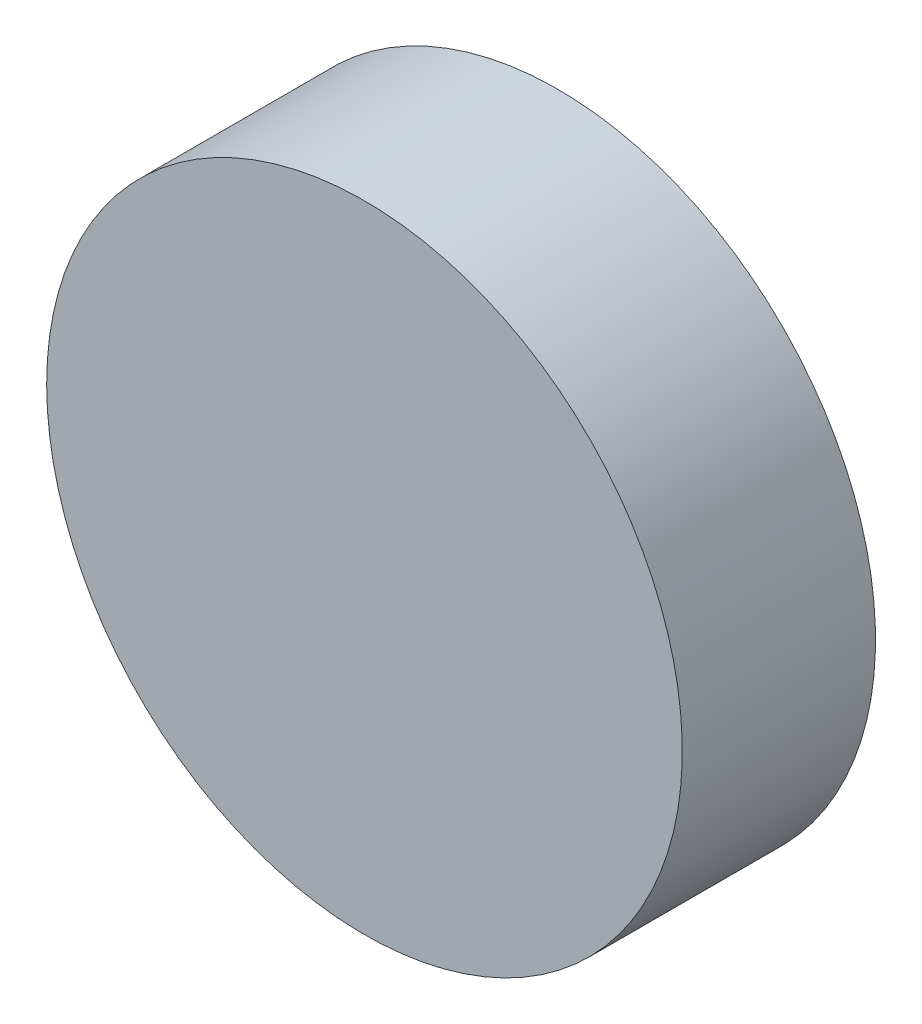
from build123d import *

# Parameters (mm, degrees)
SKETCH_1_R      = 6.25
EXTRUDE_1_DEPTH = 3.8


with BuildPart() as part:
    # Sketch 1 → Extrude 1 (new body)
    with BuildSketch(Plane.XY):
        with Locations(Location((0, 0, 0), (0, 0, 180))):
            Circle(SKETCH_1_R)
    extrude(amount=EXTRUDE_1_DEPTH)


solid = part.part
